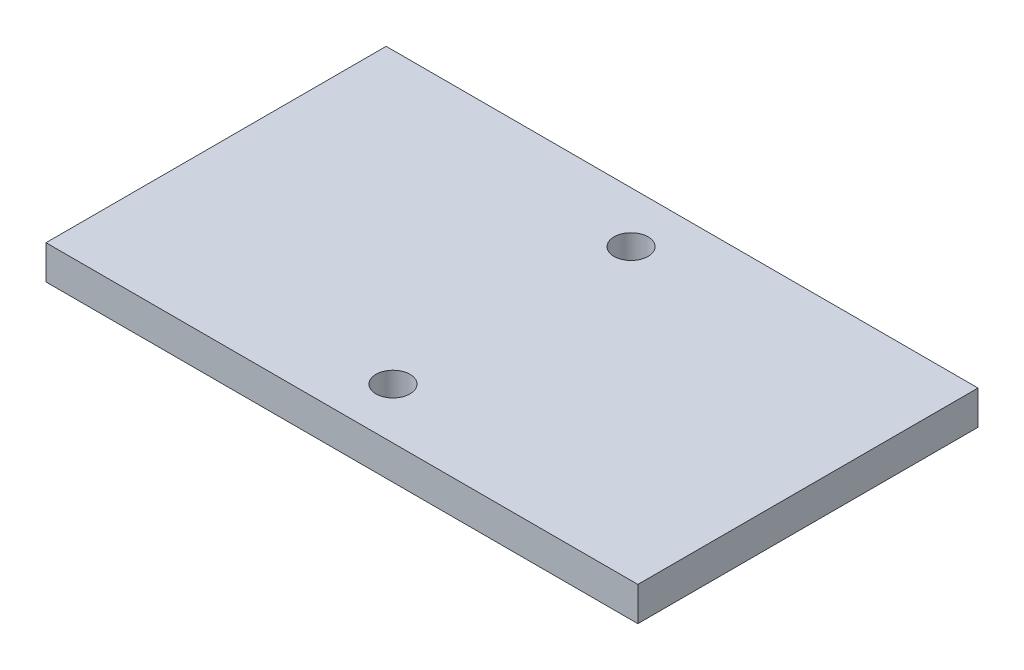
from build123d import *

# Parameters (mm, degrees)
SKETCH1_W           = 17.4
SKETCH1_H           = 10
BOSS_EXTRUDE1_DEPTH = 1
SKETCH2_R           = 0.5
CUT_EXTRUDE1_DEPTH  = 11.084145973


with BuildPart() as part:
    # Sketch1 → Boss-Extrude1 (new body)
    with BuildSketch(Plane(origin=(0, 0, 0), x_dir=(1, 0, 0), z_dir=(0, 1, 0))):
        Rectangle(SKETCH1_W, SKETCH1_H)
    extrude(amount=BOSS_EXTRUDE1_DEPTH)

    # Sketch2 → Cut-Extrude1 (cut, through all)
    with BuildSketch(Plane(origin=(0, 1, 0), x_dir=(1, 0, 0), z_dir=(0, 1, 0))):
        with Locations(Location((0, 3.5, 0), (0, 0, 270))):
            Circle(SKETCH2_R)
        with Locations(Location((0, -3.5, 0), (0, 0, 270))):
            Circle(SKETCH2_R)
    extrude(amount=-CUT_EXTRUDE1_DEPTH, mode=Mode.SUBTRACT)


solid = part.part
